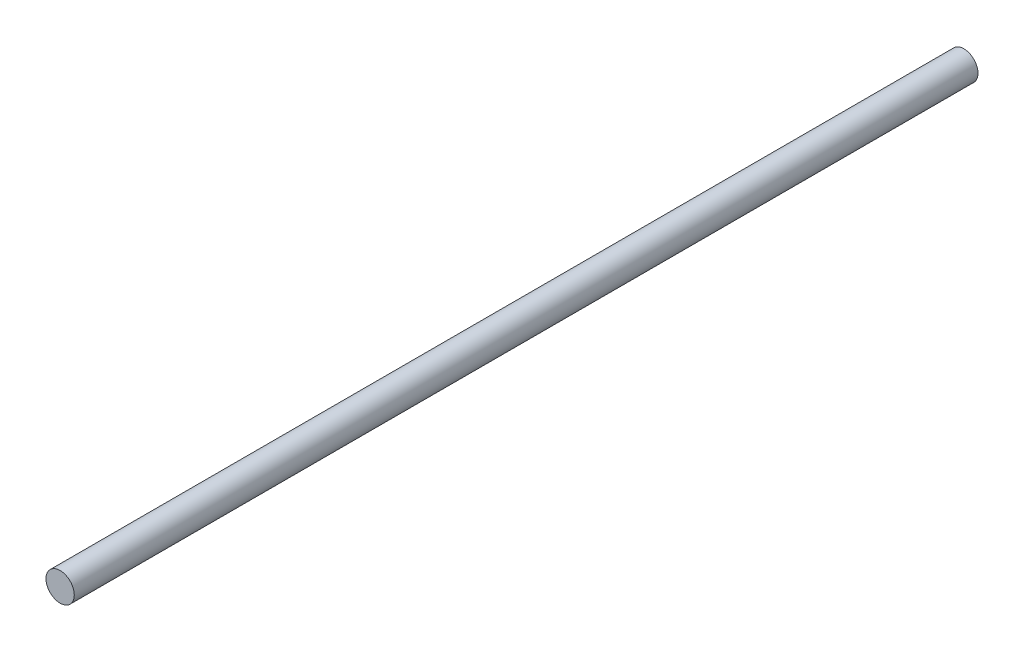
from build123d import *

# Parameters (mm, degrees)
SKETCH1_R           = 8.001
BOSS_EXTRUDE1_DEPTH = 510.8829


with BuildPart() as part:
    # Sketch1 → Boss-Extrude1 (new body)
    with BuildSketch(Plane.XY):
        Circle(SKETCH1_R)
    extrude(amount=BOSS_EXTRUDE1_DEPTH)


solid = part.part
